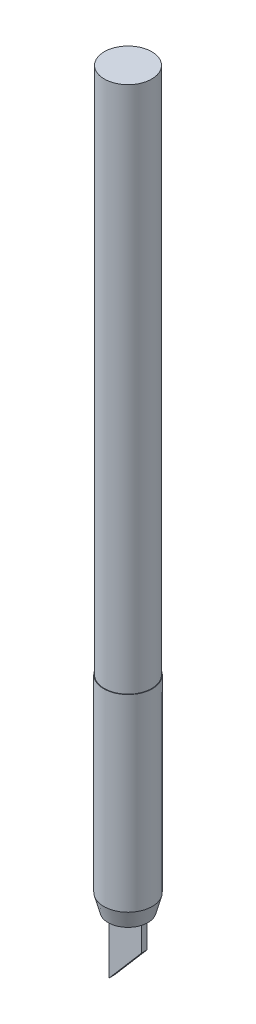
ISO-10303-21;
HEADER;
FILE_DESCRIPTION(('STEP AP214'),'2;1');
FILE_NAME('part.step','',(''),(''),'','','');
FILE_SCHEMA(('AUTOMOTIVE_DESIGN { 1 0 10303 214 1 1 1 1 }'));
ENDSEC;
DATA;
#1=APPLICATION_CONTEXT('core data for automotive mechanical design processes');
#2=APPLICATION_PROTOCOL_DEFINITION('international standard','automotive_design',2000,#1);
#3=PRODUCT_CONTEXT('',#1,'mechanical');
#4=PRODUCT('Part','Part','',(#3));
#5=PRODUCT_RELATED_PRODUCT_CATEGORY('part','',(#4));
#6=PRODUCT_DEFINITION_FORMATION('','',#4);
#7=PRODUCT_DEFINITION_CONTEXT('part definition',#1,'design');
#8=PRODUCT_DEFINITION('design','',#6,#7);
#9=PRODUCT_DEFINITION_SHAPE('','',#8);
#10=(LENGTH_UNIT() NAMED_UNIT(*) SI_UNIT(.MILLI.,.METRE.));
#11=(NAMED_UNIT(*) PLANE_ANGLE_UNIT() SI_UNIT($,.RADIAN.));
#12=(NAMED_UNIT(*) SI_UNIT($,.STERADIAN.) SOLID_ANGLE_UNIT());
#13=UNCERTAINTY_MEASURE_WITH_UNIT(LENGTH_MEASURE(1.E-05),#10,'distance_accuracy_value','');
#14=(GEOMETRIC_REPRESENTATION_CONTEXT(3) GLOBAL_UNCERTAINTY_ASSIGNED_CONTEXT((#13)) GLOBAL_UNIT_ASSIGNED_CONTEXT((#10,
#11,#12)) REPRESENTATION_CONTEXT('',''));
#15=CARTESIAN_POINT('',(0.,0.,0.));
#16=DIRECTION('',(0.,0.,1.));
#17=DIRECTION('',(1.,0.,0.));
#18=AXIS2_PLACEMENT_3D('',#15,#16,#17);
#19=CARTESIAN_POINT('',(0.,-38.,0.));
#20=DIRECTION('',(0.,-1.,0.));
#21=DIRECTION('',(0.,0.,-1.));
#22=AXIS2_PLACEMENT_3D('',#19,#20,#21);
#23=PLANE('',#22);
#24=CARTESIAN_POINT('',(0.,-38.,0.));
#25=DIRECTION('',(0.,-1.,0.));
#26=DIRECTION('',(0.,0.,-1.));
#27=AXIS2_PLACEMENT_3D('',#24,#25,#26);
#28=CIRCLE('',#27,3.69615242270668);
#29=CARTESIAN_POINT('',(0.,-38.,-3.69615242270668));
#30=VERTEX_POINT('',#29);
#31=EDGE_CURVE('E41',#30,#30,#28,.T.);
#32=ORIENTED_EDGE('',*,*,#31,.T.);
#33=EDGE_LOOP('',(#32));
#34=FACE_BOUND('',#33,.T.);
#35=DIRECTION('',(-1.,0.,0.));
#36=VECTOR('',#35,1.);
#37=CARTESIAN_POINT('',(3.,-38.,-0.5));
#38=LINE('',#37,#36);
#39=CARTESIAN_POINT('',(3.,-38.,-0.5));
#40=VERTEX_POINT('',#39);
#41=CARTESIAN_POINT('',(-3.,-38.,-0.5));
#42=VERTEX_POINT('',#41);
#43=EDGE_CURVE('E102',#40,#42,#38,.T.);
#44=ORIENTED_EDGE('',*,*,#43,.T.);
#45=DIRECTION('',(0.,0.,1.));
#46=VECTOR('',#45,1.);
#47=CARTESIAN_POINT('',(-3.,-38.,-0.5));
#48=LINE('',#47,#46);
#49=CARTESIAN_POINT('',(-3.,-38.,0.5));
#50=VERTEX_POINT('',#49);
#51=EDGE_CURVE('E108',#42,#50,#48,.T.);
#52=ORIENTED_EDGE('',*,*,#51,.T.);
#53=DIRECTION('',(-1.,0.,0.));
#54=VECTOR('',#53,1.);
#55=CARTESIAN_POINT('',(3.,-38.,0.5));
#56=LINE('',#55,#54);
#57=CARTESIAN_POINT('',(3.,-38.,0.5));
#58=VERTEX_POINT('',#57);
#59=EDGE_CURVE('E89',#58,#50,#56,.T.);
#60=ORIENTED_EDGE('',*,*,#59,.F.);
#61=DIRECTION('',(0.,0.,1.));
#62=VECTOR('',#61,1.);
#63=CARTESIAN_POINT('',(3.,-38.,-0.5));
#64=LINE('',#63,#62);
#65=EDGE_CURVE('E81',#40,#58,#64,.T.);
#66=ORIENTED_EDGE('',*,*,#65,.F.);
#67=EDGE_LOOP('',(#44,#52,#60,#66));
#68=FACE_BOUND('',#67,.T.);
#69=ADVANCED_FACE('F33',(#34,#68),#23,.T.);
#70=CARTESIAN_POINT('',(0.,98.,0.));
#71=DIRECTION('',(0.,-1.,0.));
#72=DIRECTION('',(0.,0.,-1.));
#73=AXIS2_PLACEMENT_3D('',#70,#71,#72);
#74=CYLINDRICAL_SURFACE('',#73,4.4);
#75=CARTESIAN_POINT('',(0.,98.,0.));
#76=DIRECTION('',(0.,1.,0.));
#77=DIRECTION('',(0.,0.,1.));
#78=AXIS2_PLACEMENT_3D('',#75,#76,#77);
#79=CIRCLE('',#78,4.4);
#80=CARTESIAN_POINT('',(0.,98.,4.4));
#81=VERTEX_POINT('',#80);
#82=EDGE_CURVE('E115',#81,#81,#79,.T.);
#83=ORIENTED_EDGE('',*,*,#82,.F.);
#84=EDGE_LOOP('',(#83));
#85=FACE_BOUND('',#84,.T.);
#86=CARTESIAN_POINT('',(0.,0.,0.));
#87=DIRECTION('',(0.,1.,0.));
#88=DIRECTION('',(0.,0.,1.));
#89=AXIS2_PLACEMENT_3D('',#86,#87,#88);
#90=CIRCLE('',#89,4.4);
#91=CARTESIAN_POINT('',(0.,0.,4.4));
#92=VERTEX_POINT('',#91);
#93=EDGE_CURVE('E114',#92,#92,#90,.T.);
#94=ORIENTED_EDGE('',*,*,#93,.T.);
#95=EDGE_LOOP('',(#94));
#96=FACE_BOUND('',#95,.T.);
#97=ADVANCED_FACE('F138',(#85,#96),#74,.T.);
#98=CARTESIAN_POINT('',(0.,98.,0.));
#99=DIRECTION('',(0.,1.,0.));
#100=DIRECTION('',(0.,0.,1.));
#101=AXIS2_PLACEMENT_3D('',#98,#99,#100);
#102=PLANE('',#101);
#103=ORIENTED_EDGE('',*,*,#82,.T.);
#104=EDGE_LOOP('',(#103));
#105=FACE_BOUND('',#104,.T.);
#106=ADVANCED_FACE('F143',(#105),#102,.T.);
#107=CARTESIAN_POINT('',(0.,-38.,0.));
#108=DIRECTION('',(0.,1.,0.));
#109=DIRECTION('',(0.,0.,1.));
#110=AXIS2_PLACEMENT_3D('',#107,#108,#109);
#111=CYLINDRICAL_SURFACE('',#110,4.5);
#112=CARTESIAN_POINT('',(0.,-35.0000000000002,0.));
#113=DIRECTION('',(0.,-1.,0.));
#114=DIRECTION('',(0.,0.,-1.));
#115=AXIS2_PLACEMENT_3D('',#112,#113,#114);
#116=CIRCLE('',#115,4.5);
#117=CARTESIAN_POINT('',(0.,-35.0000000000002,-4.5));
#118=VERTEX_POINT('',#117);
#119=EDGE_CURVE('E11',#118,#118,#116,.F.);
#120=ORIENTED_EDGE('',*,*,#119,.T.);
#121=EDGE_LOOP('',(#120));
#122=FACE_BOUND('',#121,.T.);
#123=CARTESIAN_POINT('',(0.,0.,0.));
#124=DIRECTION('',(0.,-1.,0.));
#125=DIRECTION('',(0.,0.,-1.));
#126=AXIS2_PLACEMENT_3D('',#123,#124,#125);
#127=CIRCLE('',#126,4.5);
#128=CARTESIAN_POINT('',(0.,0.,-4.5));
#129=VERTEX_POINT('',#128);
#130=EDGE_CURVE('E107',#129,#129,#127,.T.);
#131=ORIENTED_EDGE('',*,*,#130,.T.);
#132=EDGE_LOOP('',(#131));
#133=FACE_BOUND('',#132,.T.);
#134=ADVANCED_FACE('F133',(#122,#133),#111,.T.);
#135=CARTESIAN_POINT('',(0.,0.,0.));
#136=DIRECTION('',(0.,-1.,0.));
#137=DIRECTION('',(0.,0.,-1.));
#138=AXIS2_PLACEMENT_3D('',#135,#136,#137);
#139=PLANE('',#138);
#140=ORIENTED_EDGE('',*,*,#93,.F.);
#141=EDGE_LOOP('',(#140));
#142=FACE_BOUND('',#141,.T.);
#143=ORIENTED_EDGE('',*,*,#130,.F.);
#144=EDGE_LOOP('',(#143));
#145=FACE_BOUND('',#144,.T.);
#146=ADVANCED_FACE('F125',(#142,#145),#139,.F.);
#147=CARTESIAN_POINT('',(0.,-38.,0.));
#148=DIRECTION('',(0.,1.,0.));
#149=DIRECTION('',(0.,0.,1.));
#150=AXIS2_PLACEMENT_3D('',#147,#148,#149);
#151=CONICAL_SURFACE('',#150,3.69615242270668,0.261799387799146);
#152=ORIENTED_EDGE('',*,*,#119,.F.);
#153=EDGE_LOOP('',(#152));
#154=FACE_BOUND('',#153,.T.);
#155=ORIENTED_EDGE('',*,*,#31,.F.);
#156=EDGE_LOOP('',(#155));
#157=FACE_BOUND('',#156,.T.);
#158=ADVANCED_FACE('F35',(#154,#157),#151,.T.);
#159=CARTESIAN_POINT('',(-3.,-50.,-0.5));
#160=DIRECTION('',(0.759256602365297,-0.650791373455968,0.));
#161=DIRECTION('',(0.650791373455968,0.759256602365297,0.));
#162=AXIS2_PLACEMENT_3D('',#159,#160,#161);
#163=PLANE('',#162);
#164=DIRECTION('',(0.,0.,1.));
#165=VECTOR('',#164,1.);
#166=CARTESIAN_POINT('',(3.,-43.,-0.5));
#167=LINE('',#166,#165);
#168=CARTESIAN_POINT('',(3.,-43.,-0.5));
#169=VERTEX_POINT('',#168);
#170=CARTESIAN_POINT('',(3.,-43.,0.5));
#171=VERTEX_POINT('',#170);
#172=EDGE_CURVE('E72',#169,#171,#167,.T.);
#173=ORIENTED_EDGE('',*,*,#172,.T.);
#174=DIRECTION('',(0.650791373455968,0.759256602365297,0.));
#175=VECTOR('',#174,1.);
#176=CARTESIAN_POINT('',(-3.,-50.,0.5));
#177=LINE('',#176,#175);
#178=CARTESIAN_POINT('',(-3.,-50.,0.5));
#179=VERTEX_POINT('',#178);
#180=EDGE_CURVE('E76',#179,#171,#177,.T.);
#181=ORIENTED_EDGE('',*,*,#180,.F.);
#182=DIRECTION('',(0.,0.,1.));
#183=VECTOR('',#182,1.);
#184=CARTESIAN_POINT('',(-3.,-50.,-0.5));
#185=LINE('',#184,#183);
#186=CARTESIAN_POINT('',(-3.,-50.,-0.5));
#187=VERTEX_POINT('',#186);
#188=EDGE_CURVE('E56',#187,#179,#185,.T.);
#189=ORIENTED_EDGE('',*,*,#188,.F.);
#190=DIRECTION('',(0.650791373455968,0.759256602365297,0.));
#191=VECTOR('',#190,1.);
#192=CARTESIAN_POINT('',(-3.,-50.,-0.5));
#193=LINE('',#192,#191);
#194=EDGE_CURVE('E77',#187,#169,#193,.T.);
#195=ORIENTED_EDGE('',*,*,#194,.T.);
#196=EDGE_LOOP('',(#173,#181,#189,#195));
#197=FACE_BOUND('',#196,.T.);
#198=ADVANCED_FACE('F74',(#197),#163,.T.);
#199=CARTESIAN_POINT('',(-3.,-38.,-0.5));
#200=DIRECTION('',(-1.,0.,0.));
#201=DIRECTION('',(0.,-1.,0.));
#202=AXIS2_PLACEMENT_3D('',#199,#200,#201);
#203=PLANE('',#202);
#204=ORIENTED_EDGE('',*,*,#188,.T.);
#205=DIRECTION('',(0.,-1.,0.));
#206=VECTOR('',#205,1.);
#207=CARTESIAN_POINT('',(-3.,-38.,0.5));
#208=LINE('',#207,#206);
#209=EDGE_CURVE('E94',#50,#179,#208,.T.);
#210=ORIENTED_EDGE('',*,*,#209,.F.);
#211=ORIENTED_EDGE('',*,*,#51,.F.);
#212=DIRECTION('',(0.,-1.,0.));
#213=VECTOR('',#212,1.);
#214=CARTESIAN_POINT('',(-3.,-38.,-0.5));
#215=LINE('',#214,#213);
#216=EDGE_CURVE('E48',#42,#187,#215,.T.);
#217=ORIENTED_EDGE('',*,*,#216,.T.);
#218=EDGE_LOOP('',(#204,#210,#211,#217));
#219=FACE_BOUND('',#218,.T.);
#220=ADVANCED_FACE('F131',(#219),#203,.T.);
#221=CARTESIAN_POINT('',(3.,-43.,-0.5));
#222=DIRECTION('',(1.,0.,0.));
#223=DIRECTION('',(0.,1.,0.));
#224=AXIS2_PLACEMENT_3D('',#221,#222,#223);
#225=PLANE('',#224);
#226=ORIENTED_EDGE('',*,*,#65,.T.);
#227=DIRECTION('',(0.,1.,0.));
#228=VECTOR('',#227,1.);
#229=CARTESIAN_POINT('',(3.,-43.,0.5));
#230=LINE('',#229,#228);
#231=EDGE_CURVE('E84',#171,#58,#230,.T.);
#232=ORIENTED_EDGE('',*,*,#231,.F.);
#233=ORIENTED_EDGE('',*,*,#172,.F.);
#234=DIRECTION('',(0.,1.,0.));
#235=VECTOR('',#234,1.);
#236=CARTESIAN_POINT('',(3.,-43.,-0.5));
#237=LINE('',#236,#235);
#238=EDGE_CURVE('E100',#169,#40,#237,.T.);
#239=ORIENTED_EDGE('',*,*,#238,.T.);
#240=EDGE_LOOP('',(#226,#232,#233,#239));
#241=FACE_BOUND('',#240,.T.);
#242=ADVANCED_FACE('F85',(#241),#225,.T.);
#243=CARTESIAN_POINT('',(0.,0.,-0.5));
#244=DIRECTION('',(0.,0.,1.));
#245=DIRECTION('',(1.,0.,0.));
#246=AXIS2_PLACEMENT_3D('',#243,#244,#245);
#247=PLANE('',#246);
#248=ORIENTED_EDGE('',*,*,#194,.F.);
#249=ORIENTED_EDGE('',*,*,#216,.F.);
#250=ORIENTED_EDGE('',*,*,#43,.F.);
#251=ORIENTED_EDGE('',*,*,#238,.F.);
#252=EDGE_LOOP('',(#248,#249,#250,#251));
#253=FACE_BOUND('',#252,.T.);
#254=ADVANCED_FACE('F203',(#253),#247,.F.);
#255=CARTESIAN_POINT('',(0.,0.,0.5));
#256=DIRECTION('',(0.,0.,1.));
#257=DIRECTION('',(1.,0.,0.));
#258=AXIS2_PLACEMENT_3D('',#255,#256,#257);
#259=PLANE('',#258);
#260=ORIENTED_EDGE('',*,*,#180,.T.);
#261=ORIENTED_EDGE('',*,*,#231,.T.);
#262=ORIENTED_EDGE('',*,*,#59,.T.);
#263=ORIENTED_EDGE('',*,*,#209,.T.);
#264=EDGE_LOOP('',(#260,#261,#262,#263));
#265=FACE_BOUND('',#264,.T.);
#266=ADVANCED_FACE('F92',(#265),#259,.T.);
#267=CLOSED_SHELL('',(#69,#97,#106,#134,#146,#158,#198,#220,#242,#254,#266));
#268=MANIFOLD_SOLID_BREP('B2',#267);
#269=ADVANCED_BREP_SHAPE_REPRESENTATION('',(#18,#268),#14);
#270=SHAPE_DEFINITION_REPRESENTATION(#9,#269);
ENDSEC;
END-ISO-10303-21;
